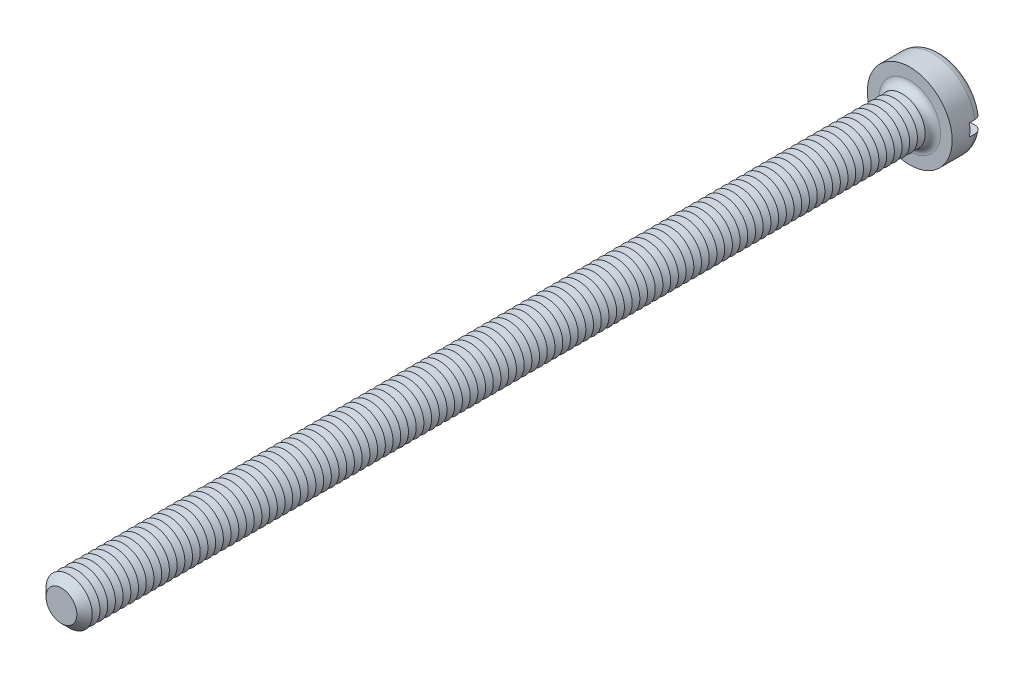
from build123d import *

# Parameters (mm, degrees)
SKETCH3_R           = 2.75
BOSS_EXTRUDE2_DEPTH = 2
SKETCH4_R           = 1.5
BOSS_EXTRUDE3_DEPTH = 55
FILLET1_R           = 0.5
CHAMFER1_SIZE       = 0.5
LPATTERN1_COUNT     = 108
LPATTERN1_PITCH     = 0.5
SKETCH8_W           = 5.5
SKETCH8_H           = 0.8
CUT_EXTRUDE1_DEPTH  = 0.85


with BuildPart() as part:
    # Sketch3 → Boss-Extrude2 (new body)
    with BuildSketch(Plane.XY):
        Circle(SKETCH3_R)
    extrude(amount=-BOSS_EXTRUDE2_DEPTH)

    # Sketch4 → Boss-Extrude3 (add)
    with BuildSketch(Plane.XY):
        Circle(SKETCH4_R)
    extrude(amount=BOSS_EXTRUDE3_DEPTH)

    # Fillet1
    fillet1_edges = [part.edges().sort_by_distance(p)[0] for p in [
        (-2.75, 0, -2),
        (-1.5, 0, 0),
    ]]
    fillet(fillet1_edges, radius=FILLET1_R)

    # Chamfer1
    chamfer1_edges = [part.edges().sort_by_distance(p)[0] for p in [
        (-1.5, 0, 55),
    ]]
    chamfer(chamfer1_edges, length=CHAMFER1_SIZE)

    # Sketch6 → Cut-Revolve1 (revolve, cut)
    with BuildSketch(Plane(origin=(0, 0, 0), x_dir=(0, 0, -1), z_dir=(1, 0, 0)), mode=Mode.PRIVATE) as cut_revolve1_sk:
        Polygon((-0.5, 1.5), (-0.75, 1.066987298), (-1, 1.5), align=None)
    cut_revolve1 = revolve(cut_revolve1_sk.sketch.rotate(Axis((0, 0, -1.694361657), (0, 0, 1)), 90), axis=Axis((0, 0, -1.694361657), (0, 0, 1)), mode=Mode.SUBTRACT)

    # LPattern1: Cut-Revolve1 ×108
    with Locations(*[(0, 0, i * LPATTERN1_PITCH) for i in range(1, LPATTERN1_COUNT)]):
        add(cut_revolve1, mode=Mode.SUBTRACT)

    # Sketch8 → Cut-Extrude1 (cut)
    with BuildSketch(Plane(origin=(0, 0, -2), x_dir=(-1, 0, 0), z_dir=(0, 0, -1))):
        Rectangle(SKETCH8_W, SKETCH8_H)
    extrude(amount=-CUT_EXTRUDE1_DEPTH, mode=Mode.SUBTRACT)


solid = part.part
